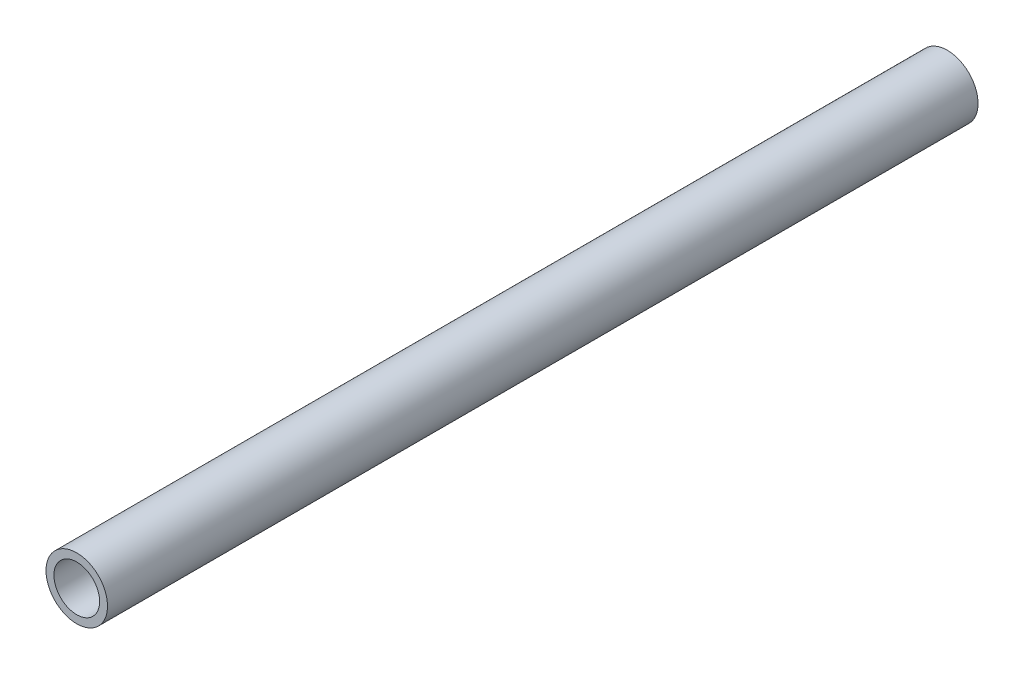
ISO-10303-21;
HEADER;
FILE_DESCRIPTION(('STEP AP214'),'2;1');
FILE_NAME('part.step','',(''),(''),'','','');
FILE_SCHEMA(('AUTOMOTIVE_DESIGN { 1 0 10303 214 1 1 1 1 }'));
ENDSEC;
DATA;
#1=APPLICATION_CONTEXT('core data for automotive mechanical design processes');
#2=APPLICATION_PROTOCOL_DEFINITION('international standard','automotive_design',2000,#1);
#3=PRODUCT_CONTEXT('',#1,'mechanical');
#4=PRODUCT('Part','Part','',(#3));
#5=PRODUCT_RELATED_PRODUCT_CATEGORY('part','',(#4));
#6=PRODUCT_DEFINITION_FORMATION('','',#4);
#7=PRODUCT_DEFINITION_CONTEXT('part definition',#1,'design');
#8=PRODUCT_DEFINITION('design','',#6,#7);
#9=PRODUCT_DEFINITION_SHAPE('','',#8);
#10=(LENGTH_UNIT() NAMED_UNIT(*) SI_UNIT(.MILLI.,.METRE.));
#11=(NAMED_UNIT(*) PLANE_ANGLE_UNIT() SI_UNIT($,.RADIAN.));
#12=(NAMED_UNIT(*) SI_UNIT($,.STERADIAN.) SOLID_ANGLE_UNIT());
#13=UNCERTAINTY_MEASURE_WITH_UNIT(LENGTH_MEASURE(1.E-05),#10,'distance_accuracy_value','');
#14=(GEOMETRIC_REPRESENTATION_CONTEXT(3) GLOBAL_UNCERTAINTY_ASSIGNED_CONTEXT((#13)) GLOBAL_UNIT_ASSIGNED_CONTEXT((#10,
#11,#12)) REPRESENTATION_CONTEXT('',''));
#15=CARTESIAN_POINT('',(0.,0.,0.));
#16=DIRECTION('',(0.,0.,1.));
#17=DIRECTION('',(1.,0.,0.));
#18=AXIS2_PLACEMENT_3D('',#15,#16,#17);
#19=CARTESIAN_POINT('',(0.,0.,152.4));
#20=DIRECTION('',(0.,0.,1.));
#21=DIRECTION('',(1.,0.,0.));
#22=AXIS2_PLACEMENT_3D('',#19,#20,#21);
#23=PLANE('',#22);
#24=CARTESIAN_POINT('',(0.,0.,152.4));
#25=DIRECTION('',(0.,0.,1.));
#26=DIRECTION('',(1.,0.,0.));
#27=AXIS2_PLACEMENT_3D('',#24,#25,#26);
#28=CIRCLE('',#27,10.7696);
#29=CARTESIAN_POINT('',(-10.7696,0.,152.4));
#30=VERTEX_POINT('',#29);
#31=EDGE_CURVE('E10',#30,#30,#28,.T.);
#32=ORIENTED_EDGE('',*,*,#31,.T.);
#33=EDGE_LOOP('',(#32));
#34=FACE_BOUND('',#33,.T.);
#35=CARTESIAN_POINT('',(0.,0.,152.4));
#36=DIRECTION('',(0.,0.,1.));
#37=DIRECTION('',(1.,0.,0.));
#38=AXIS2_PLACEMENT_3D('',#35,#36,#37);
#39=CIRCLE('',#38,8.001);
#40=CARTESIAN_POINT('',(-8.001,0.,152.4));
#41=VERTEX_POINT('',#40);
#42=EDGE_CURVE('E42',#41,#41,#39,.T.);
#43=ORIENTED_EDGE('',*,*,#42,.F.);
#44=EDGE_LOOP('',(#43));
#45=FACE_BOUND('',#44,.T.);
#46=ADVANCED_FACE('F31',(#34,#45),#23,.T.);
#47=CARTESIAN_POINT('',(0.,0.,-152.4));
#48=DIRECTION('',(0.,0.,1.));
#49=DIRECTION('',(1.,0.,0.));
#50=AXIS2_PLACEMENT_3D('',#47,#48,#49);
#51=PLANE('',#50);
#52=CARTESIAN_POINT('',(0.,0.,-152.4));
#53=DIRECTION('',(0.,0.,1.));
#54=DIRECTION('',(1.,0.,0.));
#55=AXIS2_PLACEMENT_3D('',#52,#53,#54);
#56=CIRCLE('',#55,10.7696);
#57=CARTESIAN_POINT('',(-10.7696,0.,-152.4));
#58=VERTEX_POINT('',#57);
#59=EDGE_CURVE('E35',#58,#58,#56,.T.);
#60=ORIENTED_EDGE('',*,*,#59,.F.);
#61=EDGE_LOOP('',(#60));
#62=FACE_BOUND('',#61,.T.);
#63=CARTESIAN_POINT('',(0.,0.,-152.4));
#64=DIRECTION('',(0.,0.,1.));
#65=DIRECTION('',(1.,0.,0.));
#66=AXIS2_PLACEMENT_3D('',#63,#64,#65);
#67=CIRCLE('',#66,8.001);
#68=CARTESIAN_POINT('',(-8.001,0.,-152.4));
#69=VERTEX_POINT('',#68);
#70=EDGE_CURVE('E44',#69,#69,#67,.T.);
#71=ORIENTED_EDGE('',*,*,#70,.T.);
#72=EDGE_LOOP('',(#71));
#73=FACE_BOUND('',#72,.T.);
#74=ADVANCED_FACE('F54',(#62,#73),#51,.F.);
#75=CARTESIAN_POINT('',(0.,0.,152.4));
#76=DIRECTION('',(0.,0.,-1.));
#77=DIRECTION('',(-1.,0.,0.));
#78=AXIS2_PLACEMENT_3D('',#75,#76,#77);
#79=CYLINDRICAL_SURFACE('',#78,10.7696);
#80=CARTESIAN_POINT('',(-10.7696,0.,152.4));
#81=CARTESIAN_POINT('',(-10.7696,0.,149.225));
#82=CARTESIAN_POINT('',(-10.7696,0.,146.05));
#83=CARTESIAN_POINT('',(-10.7696,0.,139.7));
#84=CARTESIAN_POINT('',(-10.7696,0.,136.525));
#85=CARTESIAN_POINT('',(-10.7696,0.,130.175));
#86=CARTESIAN_POINT('',(-10.7696,0.,127.));
#87=CARTESIAN_POINT('',(-10.7696,0.,120.65));
#88=CARTESIAN_POINT('',(-10.7696,0.,117.475));
#89=CARTESIAN_POINT('',(-10.7696,0.,111.125));
#90=CARTESIAN_POINT('',(-10.7696,0.,107.95));
#91=CARTESIAN_POINT('',(-10.7696,0.,101.6));
#92=CARTESIAN_POINT('',(-10.7696,0.,98.425));
#93=CARTESIAN_POINT('',(-10.7696,0.,92.075));
#94=CARTESIAN_POINT('',(-10.7696,0.,88.9));
#95=CARTESIAN_POINT('',(-10.7696,0.,82.55));
#96=CARTESIAN_POINT('',(-10.7696,0.,79.375));
#97=CARTESIAN_POINT('',(-10.7696,0.,73.025));
#98=CARTESIAN_POINT('',(-10.7696,0.,69.85));
#99=CARTESIAN_POINT('',(-10.7696,0.,63.5));
#100=CARTESIAN_POINT('',(-10.7696,0.,60.325));
#101=CARTESIAN_POINT('',(-10.7696,0.,53.975));
#102=CARTESIAN_POINT('',(-10.7696,0.,50.8));
#103=CARTESIAN_POINT('',(-10.7696,0.,44.45));
#104=CARTESIAN_POINT('',(-10.7696,0.,41.275));
#105=CARTESIAN_POINT('',(-10.7696,0.,34.925));
#106=CARTESIAN_POINT('',(-10.7696,0.,31.75));
#107=CARTESIAN_POINT('',(-10.7696,0.,25.4));
#108=CARTESIAN_POINT('',(-10.7696,0.,22.225));
#109=CARTESIAN_POINT('',(-10.7696,0.,15.875));
#110=CARTESIAN_POINT('',(-10.7696,0.,12.7));
#111=CARTESIAN_POINT('',(-10.7696,0.,6.34999999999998));
#112=CARTESIAN_POINT('',(-10.7696,0.,3.17499999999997));
#113=CARTESIAN_POINT('',(-10.7696,0.,-3.17500000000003));
#114=CARTESIAN_POINT('',(-10.7696,0.,-6.35000000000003));
#115=CARTESIAN_POINT('',(-10.7696,0.,-12.7));
#116=CARTESIAN_POINT('',(-10.7696,0.,-15.875));
#117=CARTESIAN_POINT('',(-10.7696,0.,-22.225));
#118=CARTESIAN_POINT('',(-10.7696,0.,-25.4));
#119=CARTESIAN_POINT('',(-10.7696,0.,-31.75));
#120=CARTESIAN_POINT('',(-10.7696,0.,-34.925));
#121=CARTESIAN_POINT('',(-10.7696,0.,-41.275));
#122=CARTESIAN_POINT('',(-10.7696,0.,-44.45));
#123=CARTESIAN_POINT('',(-10.7696,0.,-50.8));
#124=CARTESIAN_POINT('',(-10.7696,0.,-53.975));
#125=CARTESIAN_POINT('',(-10.7696,0.,-60.325));
#126=CARTESIAN_POINT('',(-10.7696,0.,-63.5));
#127=CARTESIAN_POINT('',(-10.7696,0.,-69.85));
#128=CARTESIAN_POINT('',(-10.7696,0.,-73.025));
#129=CARTESIAN_POINT('',(-10.7696,0.,-79.375));
#130=CARTESIAN_POINT('',(-10.7696,0.,-82.5500000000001));
#131=CARTESIAN_POINT('',(-10.7696,0.,-88.9));
#132=CARTESIAN_POINT('',(-10.7696,0.,-92.0750000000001));
#133=CARTESIAN_POINT('',(-10.7696,0.,-98.425));
#134=CARTESIAN_POINT('',(-10.7696,0.,-101.6));
#135=CARTESIAN_POINT('',(-10.7696,0.,-107.95));
#136=CARTESIAN_POINT('',(-10.7696,0.,-111.125));
#137=CARTESIAN_POINT('',(-10.7696,0.,-117.475));
#138=CARTESIAN_POINT('',(-10.7696,0.,-120.65));
#139=CARTESIAN_POINT('',(-10.7696,0.,-127.));
#140=CARTESIAN_POINT('',(-10.7696,0.,-130.175));
#141=CARTESIAN_POINT('',(-10.7696,0.,-136.525));
#142=CARTESIAN_POINT('',(-10.7696,0.,-139.7));
#143=CARTESIAN_POINT('',(-10.7696,0.,-146.05));
#144=CARTESIAN_POINT('',(-10.7696,0.,-149.225));
#145=CARTESIAN_POINT('',(-10.7696,0.,-152.4));
#146=B_SPLINE_CURVE_WITH_KNOTS('',3,(#80,#81,#82,#83,#84,#85,#86,#87,#88,#89,#90,#91,#92,#93,
#94,#95,#96,#97,#98,#99,#100,#101,#102,#103,#104,#105,#106,#107,#108,#109,#110,#111,#112,#113,
#114,#115,#116,#117,#118,#119,#120,#121,#122,#123,#124,#125,#126,#127,#128,#129,#130,#131,#132,
#133,#134,#135,#136,#137,#138,#139,#140,#141,#142,#143,#144,#145),.UNSPECIFIED.,.F.,.F.,(4,2,2,
2,2,2,2,2,2,2,2,2,2,2,2,2,2,2,2,2,2,2,2,2,2,2,2,2,2,2,2,2,4),(0.,9.52499999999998,19.05,28.575,
38.1,47.625,57.15,66.675,76.2,85.725,95.25,104.775,114.3,123.825,133.35,142.875,152.4,161.925,
171.45,180.975,190.5,200.025,209.55,219.075,228.6,238.125,247.65,257.175,266.7,276.225,285.75,
295.275,304.8),.UNSPECIFIED.);
#147=EDGE_CURVE('BSEAM33',#30,#58,#146,.T.);
#148=ORIENTED_EDGE('',*,*,#31,.F.);
#149=ORIENTED_EDGE('',*,*,#59,.T.);
#150=ORIENTED_EDGE('',*,*,#147,.T.);
#151=ORIENTED_EDGE('',*,*,#147,.F.);
#152=EDGE_LOOP('',(#148,#150,#149,#151));
#153=FACE_BOUND('',#152,.T.);
#154=ADVANCED_FACE('F33',(#153),#79,.T.);
#155=CARTESIAN_POINT('',(0.,0.,152.4));
#156=DIRECTION('',(0.,0.,-1.));
#157=DIRECTION('',(-1.,0.,0.));
#158=AXIS2_PLACEMENT_3D('',#155,#156,#157);
#159=CYLINDRICAL_SURFACE('',#158,8.001);
#160=CARTESIAN_POINT('',(-8.001,0.,152.4));
#161=CARTESIAN_POINT('',(-8.001,0.,149.225));
#162=CARTESIAN_POINT('',(-8.001,0.,146.05));
#163=CARTESIAN_POINT('',(-8.001,0.,139.7));
#164=CARTESIAN_POINT('',(-8.001,0.,136.525));
#165=CARTESIAN_POINT('',(-8.001,0.,130.175));
#166=CARTESIAN_POINT('',(-8.001,0.,127.));
#167=CARTESIAN_POINT('',(-8.001,0.,120.65));
#168=CARTESIAN_POINT('',(-8.001,0.,117.475));
#169=CARTESIAN_POINT('',(-8.001,0.,111.125));
#170=CARTESIAN_POINT('',(-8.001,0.,107.95));
#171=CARTESIAN_POINT('',(-8.001,0.,101.6));
#172=CARTESIAN_POINT('',(-8.001,0.,98.425));
#173=CARTESIAN_POINT('',(-8.001,0.,92.075));
#174=CARTESIAN_POINT('',(-8.001,0.,88.9));
#175=CARTESIAN_POINT('',(-8.001,0.,82.55));
#176=CARTESIAN_POINT('',(-8.001,0.,79.375));
#177=CARTESIAN_POINT('',(-8.001,0.,73.025));
#178=CARTESIAN_POINT('',(-8.001,0.,69.85));
#179=CARTESIAN_POINT('',(-8.001,0.,63.5));
#180=CARTESIAN_POINT('',(-8.001,0.,60.325));
#181=CARTESIAN_POINT('',(-8.001,0.,53.975));
#182=CARTESIAN_POINT('',(-8.001,0.,50.8));
#183=CARTESIAN_POINT('',(-8.001,0.,44.45));
#184=CARTESIAN_POINT('',(-8.001,0.,41.275));
#185=CARTESIAN_POINT('',(-8.001,0.,34.925));
#186=CARTESIAN_POINT('',(-8.001,0.,31.75));
#187=CARTESIAN_POINT('',(-8.001,0.,25.4));
#188=CARTESIAN_POINT('',(-8.001,0.,22.225));
#189=CARTESIAN_POINT('',(-8.001,0.,15.875));
#190=CARTESIAN_POINT('',(-8.001,0.,12.7));
#191=CARTESIAN_POINT('',(-8.001,0.,6.34999999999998));
#192=CARTESIAN_POINT('',(-8.001,0.,3.17499999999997));
#193=CARTESIAN_POINT('',(-8.001,0.,-3.17500000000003));
#194=CARTESIAN_POINT('',(-8.001,0.,-6.35000000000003));
#195=CARTESIAN_POINT('',(-8.001,0.,-12.7));
#196=CARTESIAN_POINT('',(-8.001,0.,-15.875));
#197=CARTESIAN_POINT('',(-8.001,0.,-22.225));
#198=CARTESIAN_POINT('',(-8.001,0.,-25.4));
#199=CARTESIAN_POINT('',(-8.001,0.,-31.75));
#200=CARTESIAN_POINT('',(-8.001,0.,-34.925));
#201=CARTESIAN_POINT('',(-8.001,0.,-41.275));
#202=CARTESIAN_POINT('',(-8.001,0.,-44.45));
#203=CARTESIAN_POINT('',(-8.001,0.,-50.8));
#204=CARTESIAN_POINT('',(-8.001,0.,-53.975));
#205=CARTESIAN_POINT('',(-8.001,0.,-60.325));
#206=CARTESIAN_POINT('',(-8.001,0.,-63.5));
#207=CARTESIAN_POINT('',(-8.001,0.,-69.85));
#208=CARTESIAN_POINT('',(-8.001,0.,-73.025));
#209=CARTESIAN_POINT('',(-8.001,0.,-79.375));
#210=CARTESIAN_POINT('',(-8.001,0.,-82.5500000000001));
#211=CARTESIAN_POINT('',(-8.001,0.,-88.9));
#212=CARTESIAN_POINT('',(-8.001,0.,-92.0750000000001));
#213=CARTESIAN_POINT('',(-8.001,0.,-98.425));
#214=CARTESIAN_POINT('',(-8.001,0.,-101.6));
#215=CARTESIAN_POINT('',(-8.001,0.,-107.95));
#216=CARTESIAN_POINT('',(-8.001,0.,-111.125));
#217=CARTESIAN_POINT('',(-8.001,0.,-117.475));
#218=CARTESIAN_POINT('',(-8.001,0.,-120.65));
#219=CARTESIAN_POINT('',(-8.001,0.,-127.));
#220=CARTESIAN_POINT('',(-8.001,0.,-130.175));
#221=CARTESIAN_POINT('',(-8.001,0.,-136.525));
#222=CARTESIAN_POINT('',(-8.001,0.,-139.7));
#223=CARTESIAN_POINT('',(-8.001,0.,-146.05));
#224=CARTESIAN_POINT('',(-8.001,0.,-149.225));
#225=CARTESIAN_POINT('',(-8.001,0.,-152.4));
#226=B_SPLINE_CURVE_WITH_KNOTS('',3,(#160,#161,#162,#163,#164,#165,#166,#167,#168,#169,#170,
#171,#172,#173,#174,#175,#176,#177,#178,#179,#180,#181,#182,#183,#184,#185,#186,#187,#188,#189,
#190,#191,#192,#193,#194,#195,#196,#197,#198,#199,#200,#201,#202,#203,#204,#205,#206,#207,#208,
#209,#210,#211,#212,#213,#214,#215,#216,#217,#218,#219,#220,#221,#222,#223,#224,#225),
.UNSPECIFIED.,.F.,.F.,(4,2,2,2,2,2,2,2,2,2,2,2,2,2,2,2,2,2,2,2,2,2,2,2,2,2,2,2,2,2,2,2,4),(0.,
9.52499999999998,19.05,28.575,38.1,47.625,57.15,66.675,76.2,85.725,95.25,104.775,114.3,123.825,
133.35,142.875,152.4,161.925,171.45,180.975,190.5,200.025,209.55,219.075,228.6,238.125,247.65,
257.175,266.7,276.225,285.75,295.275,304.8),.UNSPECIFIED.);
#227=EDGE_CURVE('BSEAM50',#41,#69,#226,.T.);
#228=ORIENTED_EDGE('',*,*,#42,.T.);
#229=ORIENTED_EDGE('',*,*,#70,.F.);
#230=ORIENTED_EDGE('',*,*,#227,.T.);
#231=ORIENTED_EDGE('',*,*,#227,.F.);
#232=EDGE_LOOP('',(#228,#230,#229,#231));
#233=FACE_BOUND('',#232,.T.);
#234=ADVANCED_FACE('F50',(#233),#159,.F.);
#235=CLOSED_SHELL('',(#46,#74,#154,#234));
#236=MANIFOLD_SOLID_BREP('B2',#235);
#237=ADVANCED_BREP_SHAPE_REPRESENTATION('',(#18,#236),#14);
#238=SHAPE_DEFINITION_REPRESENTATION(#9,#237);
ENDSEC;
END-ISO-10303-21;
